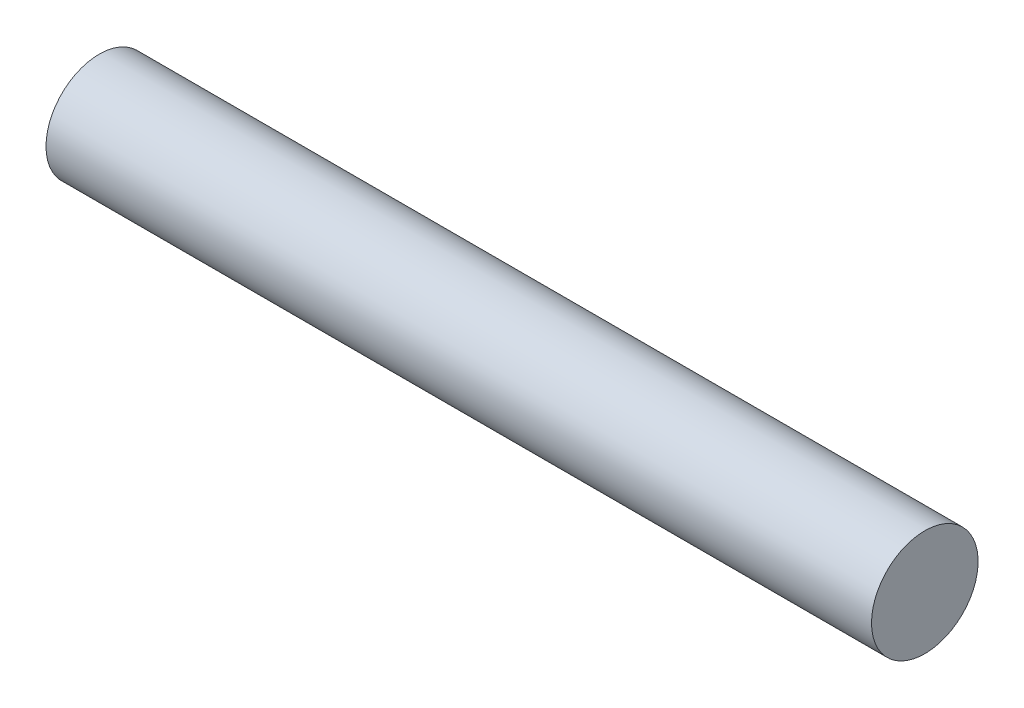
ISO-10303-21;
HEADER;
FILE_DESCRIPTION(('STEP AP214'),'2;1');
FILE_NAME('part.step','',(''),(''),'','','');
FILE_SCHEMA(('AUTOMOTIVE_DESIGN { 1 0 10303 214 1 1 1 1 }'));
ENDSEC;
DATA;
#1=APPLICATION_CONTEXT('core data for automotive mechanical design processes');
#2=APPLICATION_PROTOCOL_DEFINITION('international standard','automotive_design',2000,#1);
#3=PRODUCT_CONTEXT('',#1,'mechanical');
#4=PRODUCT('Part','Part','',(#3));
#5=PRODUCT_RELATED_PRODUCT_CATEGORY('part','',(#4));
#6=PRODUCT_DEFINITION_FORMATION('','',#4);
#7=PRODUCT_DEFINITION_CONTEXT('part definition',#1,'design');
#8=PRODUCT_DEFINITION('design','',#6,#7);
#9=PRODUCT_DEFINITION_SHAPE('','',#8);
#10=(LENGTH_UNIT() NAMED_UNIT(*) SI_UNIT(.MILLI.,.METRE.));
#11=(NAMED_UNIT(*) PLANE_ANGLE_UNIT() SI_UNIT($,.RADIAN.));
#12=(NAMED_UNIT(*) SI_UNIT($,.STERADIAN.) SOLID_ANGLE_UNIT());
#13=UNCERTAINTY_MEASURE_WITH_UNIT(LENGTH_MEASURE(1.E-05),#10,'distance_accuracy_value','');
#14=(GEOMETRIC_REPRESENTATION_CONTEXT(3) GLOBAL_UNCERTAINTY_ASSIGNED_CONTEXT((#13)) GLOBAL_UNIT_ASSIGNED_CONTEXT((#10,
#11,#12)) REPRESENTATION_CONTEXT('',''));
#15=CARTESIAN_POINT('',(0.,0.,0.));
#16=DIRECTION('',(0.,0.,1.));
#17=DIRECTION('',(1.,0.,0.));
#18=AXIS2_PLACEMENT_3D('',#15,#16,#17);
#19=CARTESIAN_POINT('',(71.552841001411,0.,0.));
#20=DIRECTION('',(1.,0.,0.));
#21=DIRECTION('',(0.,0.,-1.));
#22=AXIS2_PLACEMENT_3D('',#19,#20,#21);
#23=PLANE('',#22);
#24=CARTESIAN_POINT('',(71.552841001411,0.,0.));
#25=DIRECTION('',(-1.,0.,0.));
#26=DIRECTION('',(0.,0.,1.));
#27=AXIS2_PLACEMENT_3D('',#24,#25,#26);
#28=CIRCLE('',#27,8.5202653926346);
#29=CARTESIAN_POINT('',(71.552841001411,0.,8.5202653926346));
#30=VERTEX_POINT('',#29);
#31=EDGE_CURVE('E37',#30,#30,#28,.T.);
#32=ORIENTED_EDGE('',*,*,#31,.F.);
#33=EDGE_LOOP('',(#32));
#34=FACE_BOUND('',#33,.T.);
#35=ADVANCED_FACE('F31',(#34),#23,.T.);
#36=CARTESIAN_POINT('',(-60.424331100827,0.,0.));
#37=DIRECTION('',(-1.,0.,0.));
#38=DIRECTION('',(0.,0.,1.));
#39=AXIS2_PLACEMENT_3D('',#36,#37,#38);
#40=PLANE('',#39);
#41=CARTESIAN_POINT('',(-60.424331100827,0.,0.));
#42=DIRECTION('',(-1.,0.,0.));
#43=DIRECTION('',(0.,0.,1.));
#44=AXIS2_PLACEMENT_3D('',#41,#42,#43);
#45=CIRCLE('',#44,8.5202653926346);
#46=CARTESIAN_POINT('',(-60.424331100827,0.,8.5202653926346));
#47=VERTEX_POINT('',#46);
#48=EDGE_CURVE('E10',#47,#47,#45,.T.);
#49=ORIENTED_EDGE('',*,*,#48,.T.);
#50=EDGE_LOOP('',(#49));
#51=FACE_BOUND('',#50,.T.);
#52=ADVANCED_FACE('F47',(#51),#40,.T.);
#53=CARTESIAN_POINT('',(-89.0088478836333,0.,0.));
#54=DIRECTION('',(-1.,0.,0.));
#55=DIRECTION('',(0.,0.,1.));
#56=AXIS2_PLACEMENT_3D('',#53,#54,#55);
#57=CYLINDRICAL_SURFACE('',#56,8.5202653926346);
#58=ORIENTED_EDGE('',*,*,#31,.T.);
#59=EDGE_LOOP('',(#58));
#60=FACE_BOUND('',#59,.T.);
#61=ORIENTED_EDGE('',*,*,#48,.F.);
#62=EDGE_LOOP('',(#61));
#63=FACE_BOUND('',#62,.T.);
#64=ADVANCED_FACE('F43',(#60,#63),#57,.T.);
#65=CLOSED_SHELL('',(#35,#52,#64));
#66=MANIFOLD_SOLID_BREP('B2',#65);
#67=ADVANCED_BREP_SHAPE_REPRESENTATION('',(#18,#66),#14);
#68=SHAPE_DEFINITION_REPRESENTATION(#9,#67);
ENDSEC;
END-ISO-10303-21;
